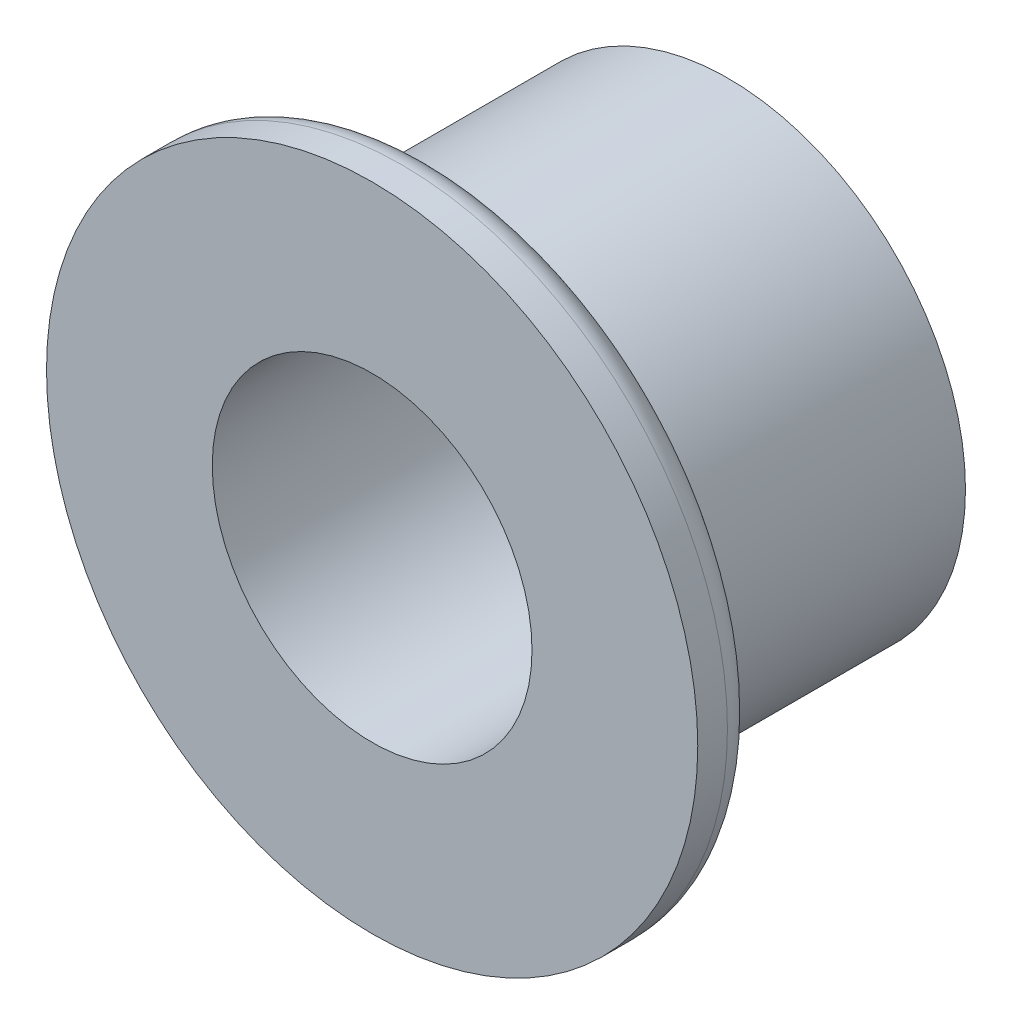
from build123d import *

# Parameters (mm, degrees)
SKETCH1_R           = 5.08
SKETCH1_R_2         = 3.422024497
BOSS_EXTRUDE1_DEPTH = 6.35
SKETCH2_R           = 6.969745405
SKETCH2_R_2         = 3.422024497
BOSS_EXTRUDE2_DEPTH = 1.27
FILLET1_R           = 0.635


with BuildPart() as part:
    # Sketch1 → Boss-Extrude1 (new body)
    with BuildSketch(Plane.XY):
        Circle(SKETCH1_R)
        Circle(SKETCH1_R_2, mode=Mode.SUBTRACT)
    extrude(amount=BOSS_EXTRUDE1_DEPTH)

    # Sketch2 → Boss-Extrude2 (add)
    with BuildSketch(Plane.XY.offset(6.35)):
        Circle(SKETCH2_R)
        Circle(SKETCH2_R_2, mode=Mode.SUBTRACT)
    extrude(amount=BOSS_EXTRUDE2_DEPTH)

    # Fillet1
    fillet1_edges = [part.edges().sort_by_distance(p)[0] for p in [
        (-6.969745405, 0, 6.35),
        (-5.08, 0, 6.35),
    ]]
    fillet(fillet1_edges, radius=FILLET1_R)


solid = part.part
